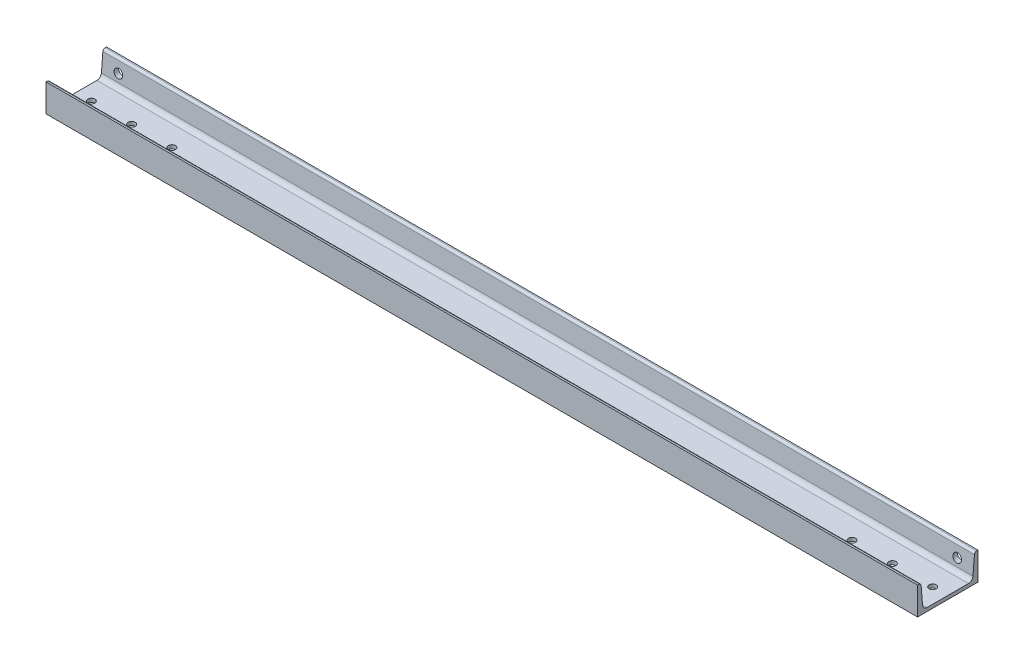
from build123d import *

# Parameters (mm, degrees)
BASE_EXTRUSION_DEPTH    = 865
ESQUISSE2_R             = 7
ENL_V_MAT_EXTRU_1_DEPTH = 869.821040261
ESQUISSE3_R             = 8.5
ENL_V_MAT_EXTRU_2_DEPTH = 10


with BuildPart() as part:
    # Esquisse1 → Base-Extrusion (new, symmetric)
    with BuildSketch(Plane(origin=(0, 0, 0), x_dir=(0, 0, -1), z_dir=(1, 0, 0))):
        with BuildLine():
            Line((-60, 0), (60, 0))
            Line((60, 0), (60, 55))
            Line((60, 55), (57.352768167, 55))
            ThreePointArc((57.352768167, 55), (54.300183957, 53.806316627), (52.867074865, 50.858546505))
            Line((52.867074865, 50.858546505), (50.02347403, 15.28290699))
            ThreePointArc((50.02347403, 15.28290699), (47.157255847, 9.387366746), (41.052087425, 7))
            Line((41.052087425, 7), (-41.052087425, 7))
            ThreePointArc((-41.052087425, 7), (-47.157255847, 9.387366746), (-50.02347403, 15.28290699))
            Line((-50.02347403, 15.28290699), (-52.867074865, 50.858546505))
            ThreePointArc((-52.867074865, 50.858546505), (-54.300183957, 53.806316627), (-57.352768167, 55))
            Line((-57.352768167, 55), (-60, 55))
            Line((-60, 55), (-60, 0))
        make_face()
    extrude(amount=BASE_EXTRUSION_DEPTH, both=True)

    # Esquisse2 → Enl_v. mat.-Extru.1 (cut, through all)
    with BuildSketch(Plane.XZ):
        with Locations(Location((835, 0, 0), (0, 0, 270))):
            Circle(ESQUISSE2_R)
        with Locations(Location((755, 0, 0), (0, 0, 270))):
            Circle(ESQUISSE2_R)
        with Locations(Location((675, 0, 0), (0, 0, 270))):
            Circle(ESQUISSE2_R)
    enl_v_mat_extru_1 = extrude(amount=-ENL_V_MAT_EXTRU_1_DEPTH, mode=Mode.SUBTRACT)

    # Sym_trie1: Enl_v. mat.-Extru.1 across plane
    add(enl_v_mat_extru_1.mirror(Plane(origin=(0, 0, 0), x_dir=(0, 0, 1), z_dir=(1, 0, 0))), mode=Mode.SUBTRACT)

    # Esquisse3 → Enl_v. mat.-Extru.2 (cut)
    with BuildSketch(Plane(origin=(0, 0, -60), x_dir=(-1, 0, 0), z_dir=(0, 0, -1))):
        with Locations(Location((832.5, 30, 0), (0, 0, 90))):
            Circle(ESQUISSE3_R)
        with Locations(Location((-832.5, 30, 0), (0, 0, 90))):
            Circle(ESQUISSE3_R)
    extrude(amount=-ENL_V_MAT_EXTRU_2_DEPTH, mode=Mode.SUBTRACT)


solid = part.part
